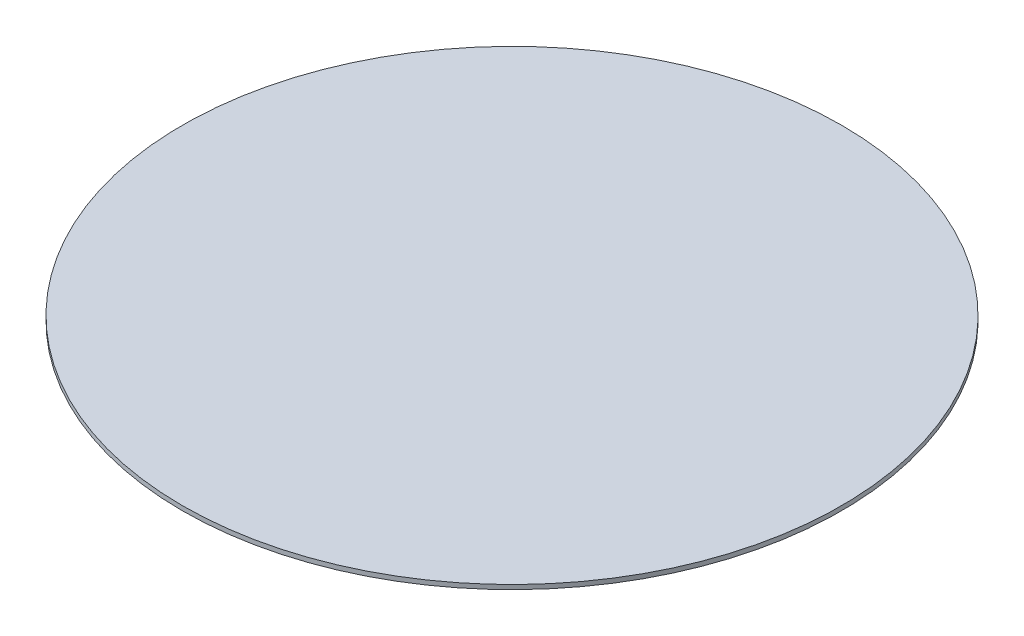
from build123d import *

# Parameters (mm, degrees)
SKETCH1_R           = 187.96
BOSS_EXTRUDE1_DEPTH = 2.54


with BuildPart() as part:
    # Sketch1 → Boss-Extrude1 (new body)
    with BuildSketch(Plane(origin=(0, 0, 0), x_dir=(1, 0, 0), z_dir=(0, 1, 0))):
        with Locations(Location((0, 0, 0), (0, 0, 270))):
            Circle(SKETCH1_R)
    extrude(amount=BOSS_EXTRUDE1_DEPTH)


solid = part.part
